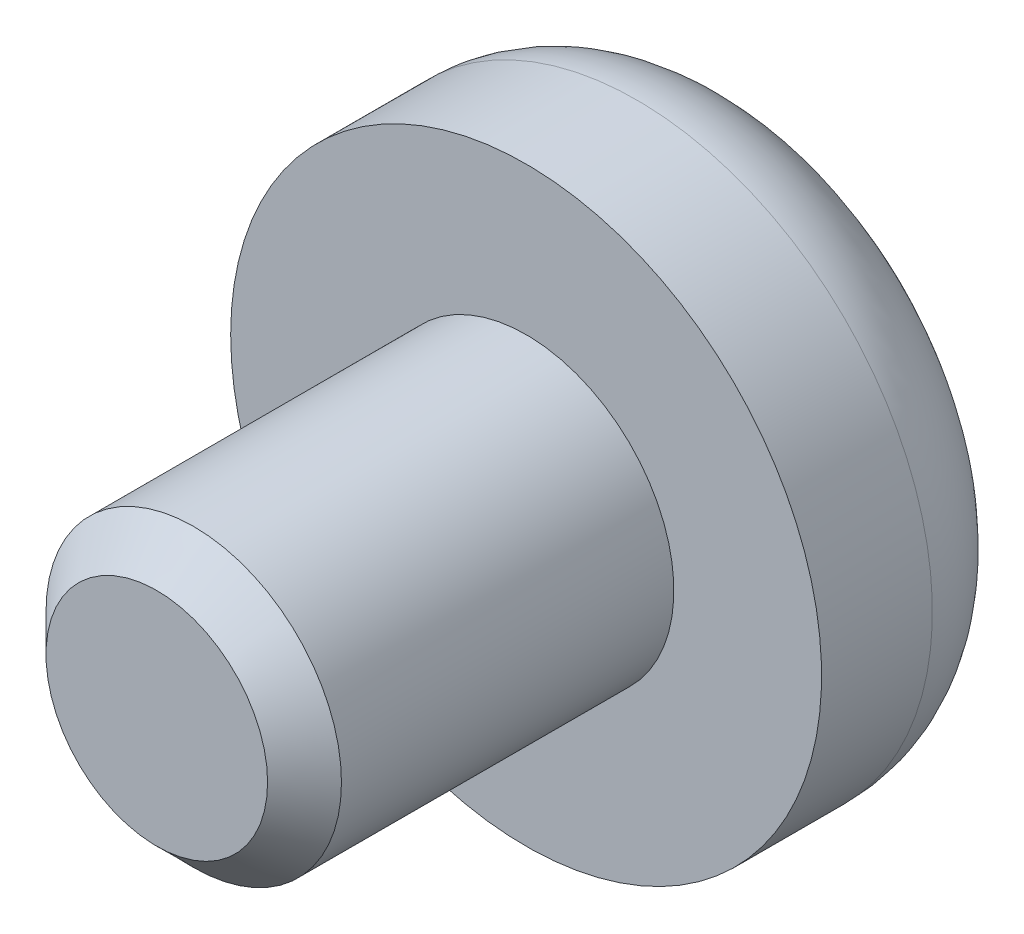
from build123d import *

# Parameters (mm, degrees)
ESQUISSE1_R        = 2
BOSS_EXTRU_1_DEPTH = 5
ESQUISSE2_R        = 4
BOSS_EXTRU_2_DEPTH = 3
CONG_1_R           = 1.5
CHANFREIN1_SIZE    = 0.5


with BuildPart() as part:
    # Esquisse1 → Boss.-Extru.1 (new body)
    with BuildSketch(Plane.XY):
        Circle(ESQUISSE1_R)
    extrude(amount=BOSS_EXTRU_1_DEPTH)

    # Esquisse2 → Boss.-Extru.2 (add)
    with BuildSketch(Plane(origin=(0, 0, 0), x_dir=(-1, 0, 0), z_dir=(0, 0, -1))):
        Circle(ESQUISSE2_R)
    extrude(amount=BOSS_EXTRU_2_DEPTH)

    # Cong_1
    cong_1_edges = [part.edges().sort_by_distance(p)[0] for p in [
        (4, 0, -3),
    ]]
    fillet(cong_1_edges, radius=CONG_1_R)

    # Chanfrein1
    chanfrein1_edges = [part.edges().sort_by_distance(p)[0] for p in [
        (-2, 0, 5),
    ]]
    chamfer(chanfrein1_edges, length=CHANFREIN1_SIZE)


solid = part.part
